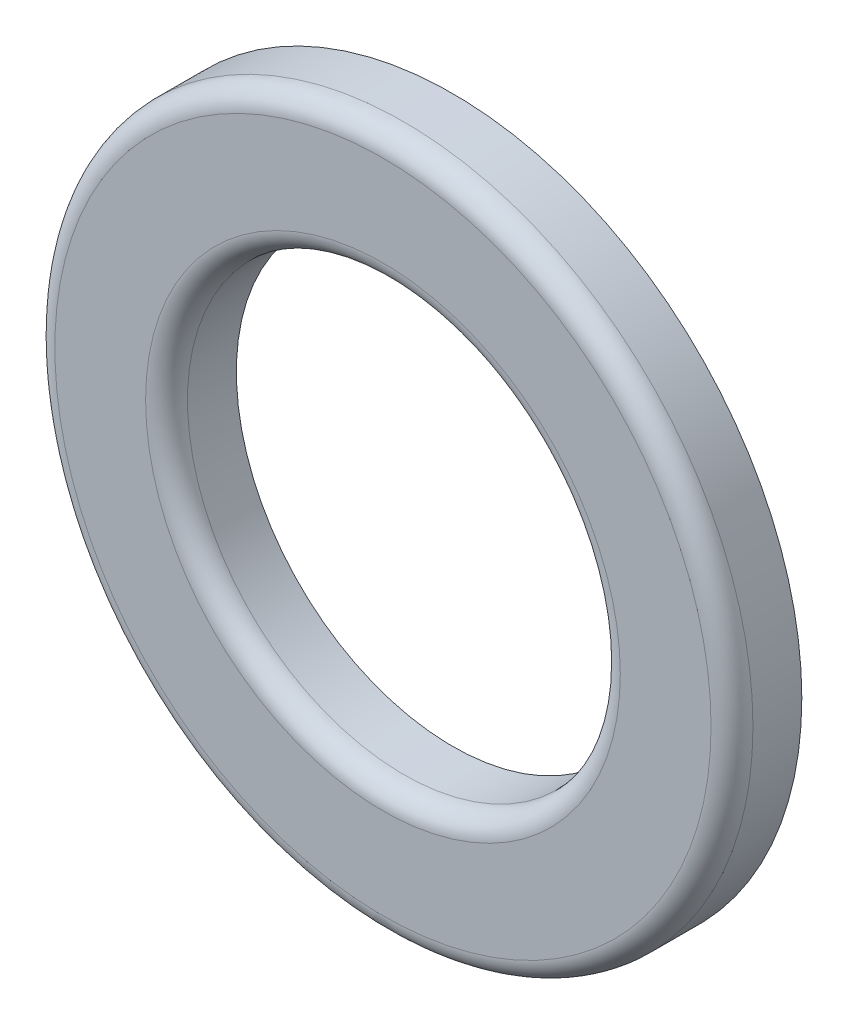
ISO-10303-21;
HEADER;
FILE_DESCRIPTION(('STEP AP214'),'2;1');
FILE_NAME('part.step','',(''),(''),'','','');
FILE_SCHEMA(('AUTOMOTIVE_DESIGN { 1 0 10303 214 1 1 1 1 }'));
ENDSEC;
DATA;
#1=APPLICATION_CONTEXT('core data for automotive mechanical design processes');
#2=APPLICATION_PROTOCOL_DEFINITION('international standard','automotive_design',2000,#1);
#3=PRODUCT_CONTEXT('',#1,'mechanical');
#4=PRODUCT('Part','Part','',(#3));
#5=PRODUCT_RELATED_PRODUCT_CATEGORY('part','',(#4));
#6=PRODUCT_DEFINITION_FORMATION('','',#4);
#7=PRODUCT_DEFINITION_CONTEXT('part definition',#1,'design');
#8=PRODUCT_DEFINITION('design','',#6,#7);
#9=PRODUCT_DEFINITION_SHAPE('','',#8);
#10=(LENGTH_UNIT() NAMED_UNIT(*) SI_UNIT(.MILLI.,.METRE.));
#11=(NAMED_UNIT(*) PLANE_ANGLE_UNIT() SI_UNIT($,.RADIAN.));
#12=(NAMED_UNIT(*) SI_UNIT($,.STERADIAN.) SOLID_ANGLE_UNIT());
#13=UNCERTAINTY_MEASURE_WITH_UNIT(LENGTH_MEASURE(1.E-05),#10,'distance_accuracy_value','');
#14=(GEOMETRIC_REPRESENTATION_CONTEXT(3) GLOBAL_UNCERTAINTY_ASSIGNED_CONTEXT((#13)) GLOBAL_UNIT_ASSIGNED_CONTEXT((#10,
#11,#12)) REPRESENTATION_CONTEXT('',''));
#15=CARTESIAN_POINT('',(0.,0.,0.));
#16=DIRECTION('',(0.,0.,1.));
#17=DIRECTION('',(1.,0.,0.));
#18=AXIS2_PLACEMENT_3D('',#15,#16,#17);
#19=CARTESIAN_POINT('',(0.,0.,1.));
#20=DIRECTION('',(0.,0.,1.));
#21=DIRECTION('',(1.,0.,0.));
#22=AXIS2_PLACEMENT_3D('',#19,#20,#21);
#23=PLANE('',#22);
#24=CARTESIAN_POINT('',(0.,0.,1.));
#25=DIRECTION('',(0.,0.,1.));
#26=DIRECTION('',(1.,0.,0.));
#27=AXIS2_PLACEMENT_3D('',#24,#25,#26);
#28=CIRCLE('',#27,4.7);
#29=CARTESIAN_POINT('',(4.7,0.,1.));
#30=VERTEX_POINT('',#29);
#31=EDGE_CURVE('E35',#30,#30,#28,.T.);
#32=ORIENTED_EDGE('',*,*,#31,.T.);
#33=EDGE_LOOP('',(#32));
#34=FACE_BOUND('',#33,.T.);
#35=CARTESIAN_POINT('',(0.,0.,1.));
#36=DIRECTION('',(0.,0.,1.));
#37=DIRECTION('',(1.,0.,0.));
#38=AXIS2_PLACEMENT_3D('',#35,#36,#37);
#39=CIRCLE('',#38,3.4);
#40=CARTESIAN_POINT('',(3.4,0.,1.));
#41=VERTEX_POINT('',#40);
#42=EDGE_CURVE('E39',#41,#41,#39,.F.);
#43=ORIENTED_EDGE('',*,*,#42,.T.);
#44=EDGE_LOOP('',(#43));
#45=FACE_BOUND('',#44,.T.);
#46=ADVANCED_FACE('F24',(#34,#45),#23,.T.);
#47=CARTESIAN_POINT('',(0.,0.,0.));
#48=DIRECTION('',(0.,0.,1.));
#49=DIRECTION('',(1.,0.,0.));
#50=AXIS2_PLACEMENT_3D('',#47,#48,#49);
#51=PLANE('',#50);
#52=CARTESIAN_POINT('',(0.,0.,0.));
#53=DIRECTION('',(0.,0.,1.));
#54=DIRECTION('',(1.,0.,0.));
#55=AXIS2_PLACEMENT_3D('',#52,#53,#54);
#56=CIRCLE('',#55,5.);
#57=CARTESIAN_POINT('',(5.,0.,0.));
#58=VERTEX_POINT('',#57);
#59=EDGE_CURVE('E44',#58,#58,#56,.T.);
#60=ORIENTED_EDGE('',*,*,#59,.F.);
#61=EDGE_LOOP('',(#60));
#62=FACE_BOUND('',#61,.T.);
#63=CARTESIAN_POINT('',(0.,0.,0.));
#64=DIRECTION('',(0.,0.,1.));
#65=DIRECTION('',(1.,0.,0.));
#66=AXIS2_PLACEMENT_3D('',#63,#64,#65);
#67=CIRCLE('',#66,3.1);
#68=CARTESIAN_POINT('',(3.1,0.,0.));
#69=VERTEX_POINT('',#68);
#70=EDGE_CURVE('E47',#69,#69,#67,.T.);
#71=ORIENTED_EDGE('',*,*,#70,.T.);
#72=EDGE_LOOP('',(#71));
#73=FACE_BOUND('',#72,.T.);
#74=ADVANCED_FACE('F51',(#62,#73),#51,.F.);
#75=CARTESIAN_POINT('',(0.,0.,1.));
#76=DIRECTION('',(0.,0.,-1.));
#77=DIRECTION('',(-1.,0.,0.));
#78=AXIS2_PLACEMENT_3D('',#75,#76,#77);
#79=CYLINDRICAL_SURFACE('',#78,5.);
#80=CARTESIAN_POINT('',(0.,0.,0.7));
#81=DIRECTION('',(0.,0.,1.));
#82=DIRECTION('',(1.,0.,0.));
#83=AXIS2_PLACEMENT_3D('',#80,#81,#82);
#84=CIRCLE('',#83,5.);
#85=CARTESIAN_POINT('',(5.,0.,0.7));
#86=VERTEX_POINT('',#85);
#87=EDGE_CURVE('E31',#86,#86,#84,.F.);
#88=ORIENTED_EDGE('',*,*,#87,.T.);
#89=EDGE_LOOP('',(#88));
#90=FACE_BOUND('',#89,.T.);
#91=ORIENTED_EDGE('',*,*,#59,.T.);
#92=EDGE_LOOP('',(#91));
#93=FACE_BOUND('',#92,.T.);
#94=ADVANCED_FACE('F26',(#90,#93),#79,.T.);
#95=CARTESIAN_POINT('',(0.,0.,1.));
#96=DIRECTION('',(0.,0.,-1.));
#97=DIRECTION('',(-1.,0.,0.));
#98=AXIS2_PLACEMENT_3D('',#95,#96,#97);
#99=CYLINDRICAL_SURFACE('',#98,3.1);
#100=CARTESIAN_POINT('',(0.,0.,0.7));
#101=DIRECTION('',(0.,0.,1.));
#102=DIRECTION('',(1.,0.,0.));
#103=AXIS2_PLACEMENT_3D('',#100,#101,#102);
#104=CIRCLE('',#103,3.1);
#105=CARTESIAN_POINT('',(3.1,0.,0.7));
#106=VERTEX_POINT('',#105);
#107=EDGE_CURVE('E10',#106,#106,#104,.T.);
#108=ORIENTED_EDGE('',*,*,#107,.T.);
#109=EDGE_LOOP('',(#108));
#110=FACE_BOUND('',#109,.T.);
#111=ORIENTED_EDGE('',*,*,#70,.F.);
#112=EDGE_LOOP('',(#111));
#113=FACE_BOUND('',#112,.T.);
#114=ADVANCED_FACE('F53',(#110,#113),#99,.F.);
#115=CARTESIAN_POINT('',(0.,0.,0.7));
#116=DIRECTION('',(0.,0.,1.));
#117=DIRECTION('',(1.,0.,0.));
#118=AXIS2_PLACEMENT_3D('',#115,#116,#117);
#119=TOROIDAL_SURFACE('',#118,4.7,0.3);
#120=ORIENTED_EDGE('',*,*,#87,.F.);
#121=EDGE_LOOP('',(#120));
#122=FACE_BOUND('',#121,.T.);
#123=ORIENTED_EDGE('',*,*,#31,.F.);
#124=EDGE_LOOP('',(#123));
#125=FACE_BOUND('',#124,.T.);
#126=ADVANCED_FACE('F55',(#122,#125),#119,.T.);
#127=CARTESIAN_POINT('',(0.,0.,0.7));
#128=DIRECTION('',(0.,0.,1.));
#129=DIRECTION('',(1.,0.,0.));
#130=AXIS2_PLACEMENT_3D('',#127,#128,#129);
#131=TOROIDAL_SURFACE('',#130,3.4,0.3);
#132=ORIENTED_EDGE('',*,*,#42,.F.);
#133=EDGE_LOOP('',(#132));
#134=FACE_BOUND('',#133,.T.);
#135=ORIENTED_EDGE('',*,*,#107,.F.);
#136=EDGE_LOOP('',(#135));
#137=FACE_BOUND('',#136,.T.);
#138=ADVANCED_FACE('F61',(#134,#137),#131,.T.);
#139=CLOSED_SHELL('',(#46,#74,#94,#114,#126,#138));
#140=MANIFOLD_SOLID_BREP('B2',#139);
#141=ADVANCED_BREP_SHAPE_REPRESENTATION('',(#18,#140),#14);
#142=SHAPE_DEFINITION_REPRESENTATION(#9,#141);
ENDSEC;
END-ISO-10303-21;
